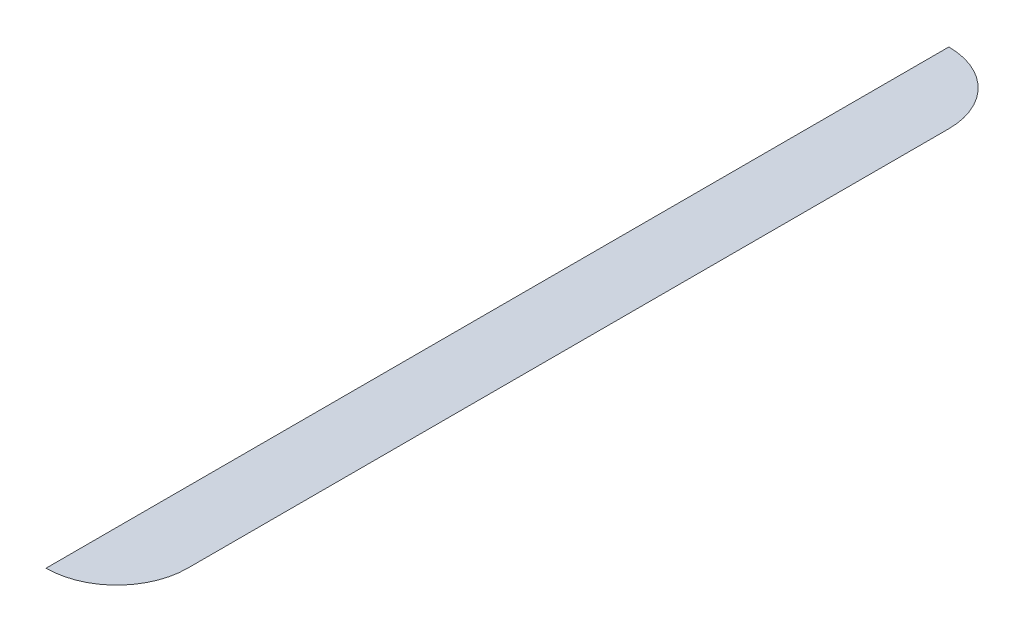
ISO-10303-21;
HEADER;
FILE_DESCRIPTION(('STEP AP214'),'2;1');
FILE_NAME('part.step','',(''),(''),'','','');
FILE_SCHEMA(('AUTOMOTIVE_DESIGN { 1 0 10303 214 1 1 1 1 }'));
ENDSEC;
DATA;
#1=APPLICATION_CONTEXT('core data for automotive mechanical design processes');
#2=APPLICATION_PROTOCOL_DEFINITION('international standard','automotive_design',2000,#1);
#3=PRODUCT_CONTEXT('',#1,'mechanical');
#4=PRODUCT('Part','Part','',(#3));
#5=PRODUCT_RELATED_PRODUCT_CATEGORY('part','',(#4));
#6=PRODUCT_DEFINITION_FORMATION('','',#4);
#7=PRODUCT_DEFINITION_CONTEXT('part definition',#1,'design');
#8=PRODUCT_DEFINITION('design','',#6,#7);
#9=PRODUCT_DEFINITION_SHAPE('','',#8);
#10=(LENGTH_UNIT() NAMED_UNIT(*) SI_UNIT(.MILLI.,.METRE.));
#11=(NAMED_UNIT(*) PLANE_ANGLE_UNIT() SI_UNIT($,.RADIAN.));
#12=(NAMED_UNIT(*) SI_UNIT($,.STERADIAN.) SOLID_ANGLE_UNIT());
#13=UNCERTAINTY_MEASURE_WITH_UNIT(LENGTH_MEASURE(1.E-05),#10,'distance_accuracy_value','');
#14=(GEOMETRIC_REPRESENTATION_CONTEXT(3) GLOBAL_UNCERTAINTY_ASSIGNED_CONTEXT((#13)) GLOBAL_UNIT_ASSIGNED_CONTEXT((#10,
#11,#12)) REPRESENTATION_CONTEXT('',''));
#15=CARTESIAN_POINT('',(0.,0.,0.));
#16=DIRECTION('',(0.,0.,1.));
#17=DIRECTION('',(1.,0.,0.));
#18=AXIS2_PLACEMENT_3D('',#15,#16,#17);
#19=CARTESIAN_POINT('',(-5.47370000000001,0.,12.7));
#20=DIRECTION('',(1.,0.,0.));
#21=DIRECTION('',(0.,0.,-1.));
#22=AXIS2_PLACEMENT_3D('',#19,#20,#21);
#23=PLANE('',#22);
#24=DIRECTION('',(0.,0.,-1.));
#25=VECTOR('',#24,1.);
#26=CARTESIAN_POINT('',(-5.47370000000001,0.,12.7));
#27=LINE('',#26,#25);
#28=CARTESIAN_POINT('',(-5.47370000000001,0.,75.3196273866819));
#29=VERTEX_POINT('',#28);
#30=CARTESIAN_POINT('',(-5.47370000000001,0.,-75.3196273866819));
#31=VERTEX_POINT('',#30);
#32=EDGE_CURVE('E109',#29,#31,#27,.T.);
#33=ORIENTED_EDGE('',*,*,#32,.T.);
#34=CARTESIAN_POINT('',(-5.47370000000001,-2.0574,-75.3196273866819));
#35=DIRECTION('',(1.,0.,0.));
#36=DIRECTION('',(0.,0.,-1.));
#37=AXIS2_PLACEMENT_3D('',#34,#35,#36);
#38=CIRCLE('',#37,2.0574);
#39=CARTESIAN_POINT('',(-5.47370000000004,-0.587965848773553,-73.8796072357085));
#40=VERTEX_POINT('',#39);
#41=EDGE_CURVE('E12',#31,#40,#38,.T.);
#42=ORIENTED_EDGE('',*,*,#41,.T.);
#43=CARTESIAN_POINT('',(-5.47370000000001,10.0036563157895,-63.5));
#44=DIRECTION('',(-1.,0.,0.));
#45=DIRECTION('',(0.,0.,1.));
#46=AXIS2_PLACEMENT_3D('',#43,#44,#45);
#47=CIRCLE('',#46,14.8296563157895);
#48=CARTESIAN_POINT('',(-5.47370000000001,-4.826,-63.5));
#49=VERTEX_POINT('',#48);
#50=EDGE_CURVE('E87',#40,#49,#47,.T.);
#51=ORIENTED_EDGE('',*,*,#50,.T.);
#52=DIRECTION('',(0.,0.,-1.));
#53=VECTOR('',#52,1.);
#54=CARTESIAN_POINT('',(-5.47370000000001,-4.826,12.7));
#55=LINE('',#54,#53);
#56=CARTESIAN_POINT('',(-5.47370000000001,-4.826,63.5));
#57=VERTEX_POINT('',#56);
#58=EDGE_CURVE('E91',#57,#49,#55,.T.);
#59=ORIENTED_EDGE('',*,*,#58,.F.);
#60=CARTESIAN_POINT('',(-5.47370000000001,10.0036563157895,63.5));
#61=DIRECTION('',(-1.,0.,0.));
#62=DIRECTION('',(0.,0.,1.));
#63=AXIS2_PLACEMENT_3D('',#60,#61,#62);
#64=CIRCLE('',#63,14.8296563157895);
#65=CARTESIAN_POINT('',(-5.47370000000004,-0.587965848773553,73.8796072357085));
#66=VERTEX_POINT('',#65);
#67=EDGE_CURVE('E95',#57,#66,#64,.T.);
#68=ORIENTED_EDGE('',*,*,#67,.T.);
#69=CARTESIAN_POINT('',(-5.47370000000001,-2.0574,75.3196273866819));
#70=DIRECTION('',(1.,0.,0.));
#71=DIRECTION('',(0.,0.,-1.));
#72=AXIS2_PLACEMENT_3D('',#69,#70,#71);
#73=CIRCLE('',#72,2.0574);
#74=EDGE_CURVE('E49',#66,#29,#73,.T.);
#75=ORIENTED_EDGE('',*,*,#74,.T.);
#76=EDGE_LOOP('',(#33,#42,#51,#59,#68,#75));
#77=FACE_BOUND('',#76,.T.);
#78=ADVANCED_FACE('F39',(#77),#23,.F.);
#79=CARTESIAN_POINT('',(-5.47370000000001,10.0036563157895,12.7));
#80=DIRECTION('',(0.,0.,-1.));
#81=DIRECTION('',(-1.,0.,0.));
#82=AXIS2_PLACEMENT_3D('',#79,#80,#81);
#83=CYLINDRICAL_SURFACE('',#82,14.8296563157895);
#84=CARTESIAN_POINT('',(-5.47370000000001,10.0036563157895,-63.5));
#85=DIRECTION('',(0.,0.,-1.));
#86=DIRECTION('',(-1.,0.,0.));
#87=AXIS2_PLACEMENT_3D('',#84,#85,#86);
#88=CIRCLE('',#87,14.8296563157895);
#89=CARTESIAN_POINT('',(4.90590723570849,-0.58796584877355,-63.5));
#90=VERTEX_POINT('',#89);
#91=EDGE_CURVE('E99',#90,#49,#88,.T.);
#92=ORIENTED_EDGE('',*,*,#91,.F.);
#93=DIRECTION('',(0.,0.,-1.));
#94=VECTOR('',#93,1.);
#95=CARTESIAN_POINT('',(4.90590723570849,-0.587965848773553,12.7));
#96=LINE('',#95,#94);
#97=CARTESIAN_POINT('',(4.90590723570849,-0.587965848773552,63.5));
#98=VERTEX_POINT('',#97);
#99=EDGE_CURVE('E116',#90,#98,#96,.F.);
#100=ORIENTED_EDGE('',*,*,#99,.T.);
#101=CARTESIAN_POINT('',(-5.47370000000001,10.0036563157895,63.5));
#102=DIRECTION('',(0.,0.,-1.));
#103=DIRECTION('',(-1.,0.,0.));
#104=AXIS2_PLACEMENT_3D('',#101,#102,#103);
#105=CIRCLE('',#104,14.8296563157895);
#106=EDGE_CURVE('E105',#98,#57,#105,.T.);
#107=ORIENTED_EDGE('',*,*,#106,.T.);
#108=ORIENTED_EDGE('',*,*,#58,.T.);
#109=EDGE_LOOP('',(#92,#100,#107,#108));
#110=FACE_BOUND('',#109,.T.);
#111=ADVANCED_FACE('F107',(#110),#83,.T.);
#112=CARTESIAN_POINT('',(-5.47370000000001,10.0036563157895,63.5));
#113=DIRECTION('',(0.,1.,0.));
#114=DIRECTION('',(0.,0.,-1.));
#115=AXIS2_PLACEMENT_3D('',#112,#113,#114);
#116=SPHERICAL_SURFACE('',#115,14.8296563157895);
#117=ORIENTED_EDGE('',*,*,#106,.F.);
#118=CARTESIAN_POINT('',(-5.47370000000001,-0.587965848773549,63.5));
#119=DIRECTION('',(0.,1.,0.));
#120=DIRECTION('',(0.,0.,1.));
#121=AXIS2_PLACEMENT_3D('',#118,#119,#120);
#122=CIRCLE('',#121,10.3796072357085);
#123=EDGE_CURVE('E118',#98,#66,#122,.F.);
#124=ORIENTED_EDGE('',*,*,#123,.T.);
#125=ORIENTED_EDGE('',*,*,#67,.F.);
#126=EDGE_LOOP('',(#117,#124,#125));
#127=FACE_BOUND('',#126,.T.);
#128=ADVANCED_FACE('F147',(#127),#116,.T.);
#129=CARTESIAN_POINT('',(-5.47370000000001,10.0036563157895,-63.5));
#130=DIRECTION('',(0.,-1.,0.));
#131=DIRECTION('',(0.,0.,-1.));
#132=AXIS2_PLACEMENT_3D('',#129,#130,#131);
#133=SPHERICAL_SURFACE('',#132,14.8296563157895);
#134=ORIENTED_EDGE('',*,*,#50,.F.);
#135=CARTESIAN_POINT('',(-5.47370000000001,-0.587965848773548,-63.5));
#136=DIRECTION('',(0.,1.,0.));
#137=DIRECTION('',(0.,0.,1.));
#138=AXIS2_PLACEMENT_3D('',#135,#136,#137);
#139=CIRCLE('',#138,10.3796072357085);
#140=EDGE_CURVE('E101',#40,#90,#139,.F.);
#141=ORIENTED_EDGE('',*,*,#140,.T.);
#142=ORIENTED_EDGE('',*,*,#91,.T.);
#143=EDGE_LOOP('',(#134,#141,#142));
#144=FACE_BOUND('',#143,.T.);
#145=ADVANCED_FACE('F100',(#144),#133,.T.);
#146=CARTESIAN_POINT('',(-5.47370000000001,-2.0574,-63.5));
#147=DIRECTION('',(0.,1.,0.));
#148=DIRECTION('',(0.,0.,1.));
#149=AXIS2_PLACEMENT_3D('',#146,#147,#148);
#150=TOROIDAL_SURFACE('',#149,11.8196273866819,2.0574);
#151=ORIENTED_EDGE('',*,*,#41,.F.);
#152=CARTESIAN_POINT('',(-5.47370000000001,0.,-63.5));
#153=DIRECTION('',(0.,1.,0.));
#154=DIRECTION('',(0.,0.,1.));
#155=AXIS2_PLACEMENT_3D('',#152,#153,#154);
#156=CIRCLE('',#155,11.8196273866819);
#157=CARTESIAN_POINT('',(6.34592738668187,0.,-63.5));
#158=VERTEX_POINT('',#157);
#159=EDGE_CURVE('E111',#158,#31,#156,.T.);
#160=ORIENTED_EDGE('',*,*,#159,.F.);
#161=CARTESIAN_POINT('',(6.34592738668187,-2.0574,-63.5));
#162=DIRECTION('',(0.,0.,-1.));
#163=DIRECTION('',(-1.,0.,0.));
#164=AXIS2_PLACEMENT_3D('',#161,#162,#163);
#165=CIRCLE('',#164,2.0574);
#166=EDGE_CURVE('E96',#90,#158,#165,.T.);
#167=ORIENTED_EDGE('',*,*,#166,.F.);
#168=ORIENTED_EDGE('',*,*,#140,.F.);
#169=EDGE_LOOP('',(#151,#160,#167,#168));
#170=FACE_BOUND('',#169,.T.);
#171=ADVANCED_FACE('F134',(#170),#150,.F.);
#172=CARTESIAN_POINT('',(6.34592738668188,-2.0574,12.7));
#173=DIRECTION('',(0.,0.,-1.));
#174=DIRECTION('',(-1.,0.,0.));
#175=AXIS2_PLACEMENT_3D('',#172,#173,#174);
#176=CYLINDRICAL_SURFACE('',#175,2.0574);
#177=ORIENTED_EDGE('',*,*,#166,.T.);
#178=DIRECTION('',(0.,0.,-1.));
#179=VECTOR('',#178,1.);
#180=CARTESIAN_POINT('',(6.34592738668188,0.,38.1));
#181=LINE('',#180,#179);
#182=CARTESIAN_POINT('',(6.34592738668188,0.,63.5));
#183=VERTEX_POINT('',#182);
#184=EDGE_CURVE('E83',#183,#158,#181,.T.);
#185=ORIENTED_EDGE('',*,*,#184,.F.);
#186=CARTESIAN_POINT('',(6.34592738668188,-2.0574,63.5));
#187=DIRECTION('',(0.,0.,-1.));
#188=DIRECTION('',(-1.,0.,0.));
#189=AXIS2_PLACEMENT_3D('',#186,#187,#188);
#190=CIRCLE('',#189,2.0574);
#191=EDGE_CURVE('E43',#98,#183,#190,.T.);
#192=ORIENTED_EDGE('',*,*,#191,.F.);
#193=ORIENTED_EDGE('',*,*,#99,.F.);
#194=EDGE_LOOP('',(#177,#185,#192,#193));
#195=FACE_BOUND('',#194,.T.);
#196=ADVANCED_FACE('F132',(#195),#176,.F.);
#197=CARTESIAN_POINT('',(-5.47370000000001,-2.0574,63.5));
#198=DIRECTION('',(0.,1.,0.));
#199=DIRECTION('',(0.,0.,1.));
#200=AXIS2_PLACEMENT_3D('',#197,#198,#199);
#201=TOROIDAL_SURFACE('',#200,11.8196273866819,2.0574);
#202=ORIENTED_EDGE('',*,*,#74,.F.);
#203=ORIENTED_EDGE('',*,*,#123,.F.);
#204=ORIENTED_EDGE('',*,*,#191,.T.);
#205=CARTESIAN_POINT('',(-5.47370000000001,0.,63.5));
#206=DIRECTION('',(0.,1.,0.));
#207=DIRECTION('',(0.,0.,1.));
#208=AXIS2_PLACEMENT_3D('',#205,#206,#207);
#209=CIRCLE('',#208,11.8196273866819);
#210=EDGE_CURVE('E79',#29,#183,#209,.T.);
#211=ORIENTED_EDGE('',*,*,#210,.F.);
#212=EDGE_LOOP('',(#202,#203,#204,#211));
#213=FACE_BOUND('',#212,.T.);
#214=ADVANCED_FACE('F41',(#213),#201,.F.);
#215=CARTESIAN_POINT('',(15.,0.,-38.1));
#216=DIRECTION('',(0.,-1.,0.));
#217=DIRECTION('',(0.,0.,-1.));
#218=AXIS2_PLACEMENT_3D('',#215,#216,#217);
#219=PLANE('',#218);
#220=ORIENTED_EDGE('',*,*,#210,.T.);
#221=ORIENTED_EDGE('',*,*,#184,.T.);
#222=ORIENTED_EDGE('',*,*,#159,.T.);
#223=ORIENTED_EDGE('',*,*,#32,.F.);
#224=EDGE_LOOP('',(#220,#221,#222,#223));
#225=FACE_BOUND('',#224,.T.);
#226=ADVANCED_FACE('F135',(#225),#219,.F.);
#227=CLOSED_SHELL('',(#78,#111,#128,#145,#171,#196,#214,#226));
#228=MANIFOLD_SOLID_BREP('B2',#227);
#229=ADVANCED_BREP_SHAPE_REPRESENTATION('',(#18,#228),#14);
#230=SHAPE_DEFINITION_REPRESENTATION(#9,#229);
ENDSEC;
END-ISO-10303-21;
